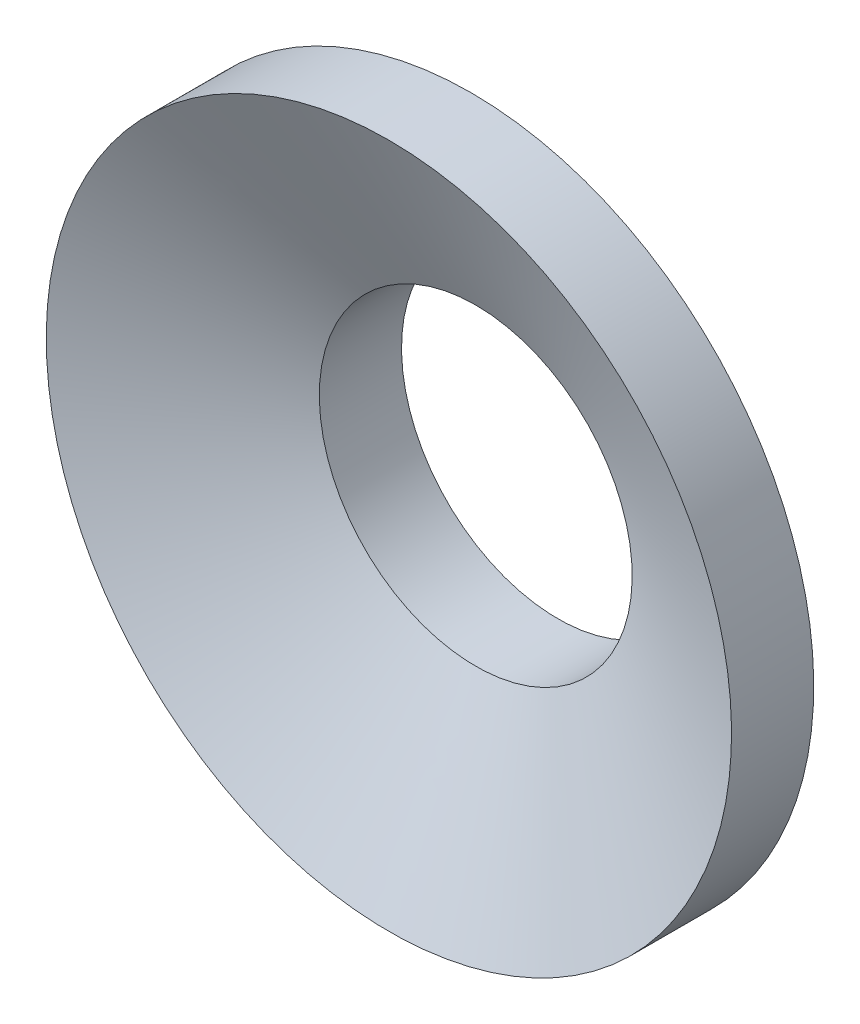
ISO-10303-21;
HEADER;
FILE_DESCRIPTION(('STEP AP214'),'2;1');
FILE_NAME('part.step','',(''),(''),'','','');
FILE_SCHEMA(('AUTOMOTIVE_DESIGN { 1 0 10303 214 1 1 1 1 }'));
ENDSEC;
DATA;
#1=APPLICATION_CONTEXT('core data for automotive mechanical design processes');
#2=APPLICATION_PROTOCOL_DEFINITION('international standard','automotive_design',2000,#1);
#3=PRODUCT_CONTEXT('',#1,'mechanical');
#4=PRODUCT('Part','Part','',(#3));
#5=PRODUCT_RELATED_PRODUCT_CATEGORY('part','',(#4));
#6=PRODUCT_DEFINITION_FORMATION('','',#4);
#7=PRODUCT_DEFINITION_CONTEXT('part definition',#1,'design');
#8=PRODUCT_DEFINITION('design','',#6,#7);
#9=PRODUCT_DEFINITION_SHAPE('','',#8);
#10=(LENGTH_UNIT() NAMED_UNIT(*) SI_UNIT(.MILLI.,.METRE.));
#11=(NAMED_UNIT(*) PLANE_ANGLE_UNIT() SI_UNIT($,.RADIAN.));
#12=(NAMED_UNIT(*) SI_UNIT($,.STERADIAN.) SOLID_ANGLE_UNIT());
#13=UNCERTAINTY_MEASURE_WITH_UNIT(LENGTH_MEASURE(1.E-05),#10,'distance_accuracy_value','');
#14=(GEOMETRIC_REPRESENTATION_CONTEXT(3) GLOBAL_UNCERTAINTY_ASSIGNED_CONTEXT((#13)) GLOBAL_UNIT_ASSIGNED_CONTEXT((#10,
#11,#12)) REPRESENTATION_CONTEXT('',''));
#15=CARTESIAN_POINT('',(0.,0.,0.));
#16=DIRECTION('',(0.,0.,1.));
#17=DIRECTION('',(1.,0.,0.));
#18=AXIS2_PLACEMENT_3D('',#15,#16,#17);
#19=DIRECTION('',(0.,0.90630778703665,0.422618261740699));
#20=VECTOR('',#19,1.);
#21=CARTESIAN_POINT('',(0.,8.375,4.2156562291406));
#22=LINE('',#21,#20);
#23=CARTESIAN_POINT('',(0.,0.,0.310329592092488));
#24=DIRECTION('',(0.,0.,1.));
#25=AXIS1_PLACEMENT('',#23,#24);
#26=SURFACE_OF_REVOLUTION('',#22,#25);
#27=CARTESIAN_POINT('',(0.,0.,2.75844479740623));
#28=DIRECTION('',(0.,0.,1.));
#29=DIRECTION('',(0.,1.,0.));
#30=AXIS2_PLACEMENT_3D('',#27,#28,#29);
#31=CIRCLE('',#30,5.25);
#32=CARTESIAN_POINT('',(0.,5.25,2.75844479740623));
#33=VERTEX_POINT('',#32);
#34=EDGE_CURVE('E28',#33,#33,#31,.T.);
#35=ORIENTED_EDGE('',*,*,#34,.F.);
#36=EDGE_LOOP('',(#35));
#37=FACE_BOUND('',#36,.T.);
#38=CARTESIAN_POINT('',(0.,0.,5.67286766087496));
#39=DIRECTION('',(0.,0.,1.));
#40=DIRECTION('',(0.,1.,0.));
#41=AXIS2_PLACEMENT_3D('',#38,#39,#40);
#42=CIRCLE('',#41,11.5);
#43=CARTESIAN_POINT('',(0.,11.5,5.67286766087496));
#44=VERTEX_POINT('',#43);
#45=EDGE_CURVE('E32',#44,#44,#42,.T.);
#46=ORIENTED_EDGE('',*,*,#45,.T.);
#47=EDGE_LOOP('',(#46));
#48=FACE_BOUND('',#47,.T.);
#49=ADVANCED_FACE('F15',(#37,#48),#26,.F.);
#50=CARTESIAN_POINT('',(0.,0.,4.29364526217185));
#51=DIRECTION('',(0.,0.,1.));
#52=DIRECTION('',(1.,0.,0.));
#53=AXIS2_PLACEMENT_3D('',#50,#51,#52);
#54=CYLINDRICAL_SURFACE('',#53,11.5);
#55=CARTESIAN_POINT('',(0.,0.,2.91442286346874));
#56=DIRECTION('',(0.,0.,1.));
#57=DIRECTION('',(0.,1.,0.));
#58=AXIS2_PLACEMENT_3D('',#55,#56,#57);
#59=CIRCLE('',#58,11.5);
#60=CARTESIAN_POINT('',(0.,11.5,2.91442286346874));
#61=VERTEX_POINT('',#60);
#62=EDGE_CURVE('E10',#61,#61,#59,.T.);
#63=ORIENTED_EDGE('',*,*,#62,.T.);
#64=EDGE_LOOP('',(#63));
#65=FACE_BOUND('',#64,.T.);
#66=ORIENTED_EDGE('',*,*,#45,.F.);
#67=EDGE_LOOP('',(#66));
#68=FACE_BOUND('',#67,.T.);
#69=ADVANCED_FACE('F41',(#65,#68),#54,.T.);
#70=DIRECTION('',(0.,-0.90630778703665,-0.422618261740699));
#71=VECTOR('',#70,1.);
#72=CARTESIAN_POINT('',(0.,8.375,1.45721143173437));
#73=LINE('',#72,#71);
#74=CARTESIAN_POINT('',(0.,0.,-2.44811520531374));
#75=DIRECTION('',(0.,0.,1.));
#76=AXIS1_PLACEMENT('',#74,#75);
#77=SURFACE_OF_REVOLUTION('',#73,#76);
#78=CARTESIAN_POINT('',(0.,0.,0.));
#79=DIRECTION('',(0.,0.,1.));
#80=DIRECTION('',(0.,1.,0.));
#81=AXIS2_PLACEMENT_3D('',#78,#79,#80);
#82=CIRCLE('',#81,5.25);
#83=CARTESIAN_POINT('',(0.,5.25,0.));
#84=VERTEX_POINT('',#83);
#85=EDGE_CURVE('E23',#84,#84,#82,.T.);
#86=ORIENTED_EDGE('',*,*,#85,.T.);
#87=EDGE_LOOP('',(#86));
#88=FACE_BOUND('',#87,.T.);
#89=ORIENTED_EDGE('',*,*,#62,.F.);
#90=EDGE_LOOP('',(#89));
#91=FACE_BOUND('',#90,.T.);
#92=ADVANCED_FACE('F44',(#88,#91),#77,.F.);
#93=CARTESIAN_POINT('',(0.,0.,1.37922239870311));
#94=DIRECTION('',(0.,0.,-1.));
#95=DIRECTION('',(0.,1.,0.));
#96=AXIS2_PLACEMENT_3D('',#93,#94,#95);
#97=CIRCLE('',#96,5.25);
#98=DIRECTION('',(0.,0.,1.));
#99=VECTOR('',#98,1.);
#100=SURFACE_OF_LINEAR_EXTRUSION('',#97,#99);
#101=ORIENTED_EDGE('',*,*,#85,.F.);
#102=EDGE_LOOP('',(#101));
#103=FACE_BOUND('',#102,.T.);
#104=ORIENTED_EDGE('',*,*,#34,.T.);
#105=EDGE_LOOP('',(#104));
#106=FACE_BOUND('',#105,.T.);
#107=ADVANCED_FACE('F17',(#103,#106),#100,.T.);
#108=CLOSED_SHELL('',(#49,#69,#92,#107));
#109=MANIFOLD_SOLID_BREP('B1',#108);
#110=ADVANCED_BREP_SHAPE_REPRESENTATION('',(#18,#109),#14);
#111=SHAPE_DEFINITION_REPRESENTATION(#9,#110);
ENDSEC;
END-ISO-10303-21;
